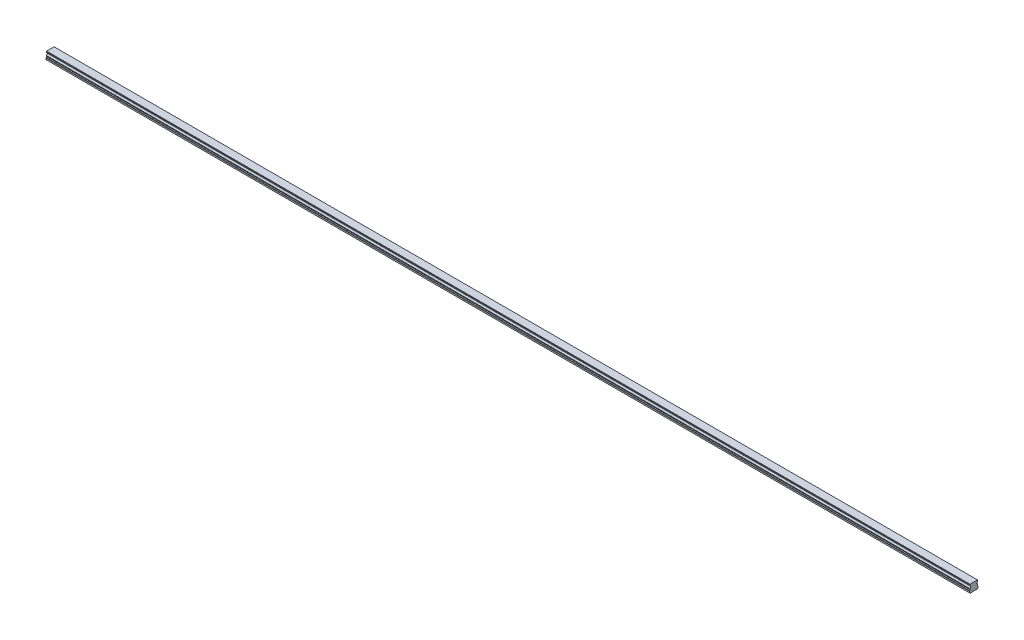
from build123d import *

# Parameters (mm, degrees)
BOSS_EXTRUDE1_DEPTH        = 1620
SKETCH3_R                  = 2.5
SKETCH3_R_2                = 2.1
CUT_EXTRUDE3_DEPTH         = 7
SKETCH3_2_R                = 2.1
CUT_EXTRUDE4_DEPTH         = 9.5
CHAMFER1_SIZE              = 0.4
LPATTERN2_COUNT            = 27
LPATTERN2_PITCH            = 60
CHAMFER1_OF_LPATTERN2_SIZE = 0.4


with BuildPart() as part:
    # Sketch1 → Boss-Extrude1 (new body)
    with BuildSketch(Plane(origin=(0, 0, 0), x_dir=(0, 0, -1), z_dir=(1, 0, 0))):
        with BuildLine():
            Line((6.59, 14), (-6.59, 14))
            Line((-6.59, 14), (-6.59, 13.15))
            Line((-6.59, 13.15), (-6.96, 12.356532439))
            Line((-6.96, 12.356532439), (-6.96, 11.435174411))
            ThreePointArc((-6.96, 11.435174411), (-5.25, 9.5), (-6.96, 7.564825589))
            Line((-6.96, 7.564825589), (-6.96, 6.643467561))
            Line((-6.96, 6.643467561), (-6.59, 5.85))
            Line((-6.59, 5.85), (-7.032116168, 4.2))
            Line((-7.032116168, 4.2), (-7.5, 3.929867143))
            Line((-7.5, 3.929867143), (-7.5, 1.4))
            Line((-7.5, 1.4), (-6.1, 0))
            Line((-6.1, 0), (-3.65, 0))
            Line((-3.65, 0), (-3.25, 0.4))
            Line((-3.25, 0.4), (3.25, 0.4))
            Line((3.25, 0.4), (3.65, 0))
            Line((3.65, 0), (6.1, 0))
            Line((6.1, 0), (7.5, 1.4))
            Line((7.5, 1.4), (7.5, 3.929867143))
            Line((7.5, 3.929867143), (7.032116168, 4.2))
            Line((7.032116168, 4.2), (6.59, 5.85))
            Line((6.59, 5.85), (6.96, 6.643467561))
            Line((6.96, 6.643467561), (6.96, 7.564825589))
            ThreePointArc((6.96, 7.564825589), (5.25, 9.5), (6.96, 11.435174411))
            Line((6.96, 11.435174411), (6.96, 12.356532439))
            Line((6.96, 12.356532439), (6.59, 13.15))
            Line((6.59, 13.15), (6.59, 14))
        make_face()
    extrude(amount=BOSS_EXTRUDE1_DEPTH)

    # Sketch3 → Cut-Extrude3 (cut)
    with BuildSketch(Plane.XZ):
        with Locations(Location((30, 0, 0), (0, 0, 270))):
            Circle(SKETCH3_R)
        with Locations(Location((30, 0, 0), (0, 0, 270))):
            Circle(SKETCH3_R_2, mode=Mode.SUBTRACT)
    cut_extrude3 = extrude(amount=-CUT_EXTRUDE3_DEPTH, mode=Mode.SUBTRACT)

    # Sketch3_2 → Cut-Extrude4 (cut)
    with BuildSketch(Plane.XZ):
        with Locations(Location((30, 0, 0), (0, 0, 270))):
            Circle(SKETCH3_2_R)
    cut_extrude4 = extrude(amount=-CUT_EXTRUDE4_DEPTH, mode=Mode.SUBTRACT)

    # Cut-Extrude5 cone 1 section (on through the dimple's axis) → Cut-Extrude5 (revolve, cut)
    with BuildSketch(Plane(origin=(30, 9.5, 0), x_dir=(0, 0, -1), z_dir=(1, 0, 0))):
        Polygon((0, 0), (2.1, 0), (0, 1.212435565), align=None)
    revolve(axis=Axis((30, 9.5, 0), (0, 1, 0)), mode=Mode.SUBTRACT)

    # Chamfer1
    chamfer1_edges = [part.edges().sort_by_distance(p)[0] for p in [
        (30, 0.4, 2.5),
    ]]
    chamfer(chamfer1_edges, length=CHAMFER1_SIZE)

    # LPattern2: Cut-Extrude3, Cut-Extrude4 ×27
    with Locations(*[(i * LPATTERN2_PITCH, 0, 0) for i in range(1, LPATTERN2_COUNT)]):
        add(cut_extrude3, mode=Mode.SUBTRACT)
        add(cut_extrude4, mode=Mode.SUBTRACT)

    # Chamfer1 of LPattern2
    chamfer1_of_lpattern2_edges = [part.edges().sort_by_distance(p)[0] for p in [
        (90, 0.4, 2.5),
        (150, 0.4, 2.5),
        (210, 0.4, 2.5),
        (270, 0.4, 2.5),
        (330, 0.4, 2.5),
        (390, 0.4, 2.5),
        (450, 0.4, 2.5),
        (510, 0.4, 2.5),
        (570, 0.4, 2.5),
        (630, 0.4, 2.5),
        (690, 0.4, 2.5),
        (750, 0.4, 2.5),
        (810, 0.4, 2.5),
        (870, 0.4, 2.5),
        (930, 0.4, 2.5),
        (990, 0.4, 2.5),
        (1050, 0.4, 2.5),
        (1110, 0.4, 2.5),
        (1170, 0.4, 2.5),
        (1230, 0.4, 2.5),
        (1290, 0.4, 2.5),
        (1350, 0.4, 2.5),
        (1410, 0.4, 2.5),
        (1470, 0.4, 2.5),
        (1530, 0.4, 2.5),
        (1590, 0.4, 2.5),
    ]]
    chamfer(chamfer1_of_lpattern2_edges, length=CHAMFER1_OF_LPATTERN2_SIZE)


solid = part.part
